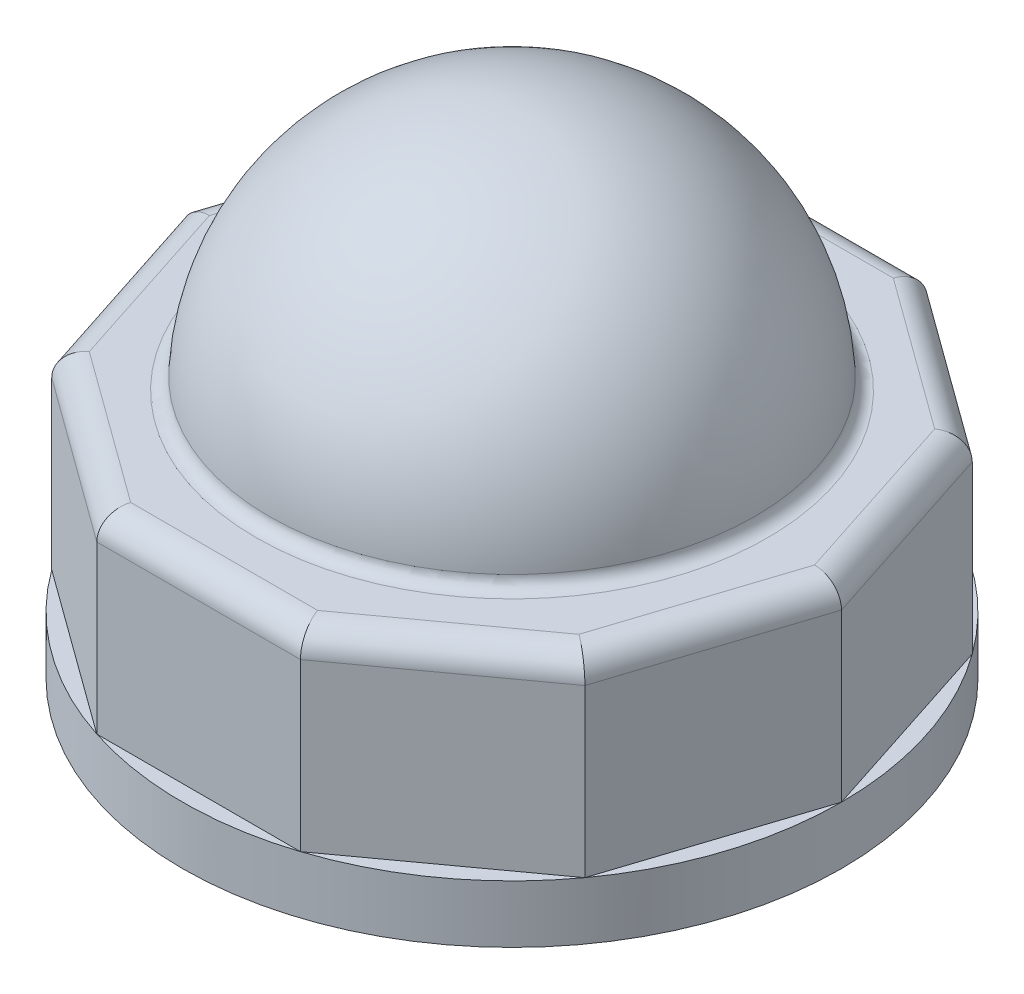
from build123d import *

# Parameters (mm, degrees)
ENL_V_START             = 5
ESQUISSE2_OUTSIDE_W     = 70.024
ESQUISSE2_OUTSIDE_H     = 70.024
ENL_V_MAT_EXTRU_2_DEPTH = 20
CONG_1_R                = 1
CONG_2_R                = 2


with BuildPart() as part:
    # Esquisse1 → R_volution1 (revolve)
    with BuildSketch(Plane.XY, mode=Mode.PRIVATE) as r_volution1_sk:
        with BuildLine():
            Line((18, 16), (18, 17))
            Line((18, 17), (16, 17))
            Line((16, 17), (16, 20))
            ThreePointArc((16, 20), (11.313708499, 31.313708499), (0, 36))
            Line((0, 36), (0, 39))
            ThreePointArc((0, 39), (13.435028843, 33.435028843), (19, 20))
            Line((19, 20), (25.75, 20))
            Line((25.75, 20), (25.75, 0.5))
            Line((25.75, 0.5), (24, 0.5))
            Line((24, 0.5), (24, 0))
            Line((24, 0), (23.5, 0))
            Line((23.5, 0), (23.5, 1))
            Line((23.5, 1), (23, 1))
            Line((23, 1), (23, 3))
            Line((23, 3), (21, 3))
            Line((21, 3), (21, 16))
            Line((21, 16), (18, 16))
        make_face()
    revolve(r_volution1_sk.sketch.rotate(Axis((0, 0, 0), (0, 1, 0)), 90), axis=Axis((0, 0, 0), (0, 1, 0)))

    # Esquisse2 outside → Enl_v. mat.-Extru.2 (cut)
    with BuildSketch(Plane(origin=(0, 0, 0), x_dir=(1, 0, 0), z_dir=(0, 1, 0)).offset(ENL_V_START)):
        Rectangle(ESQUISSE2_OUTSIDE_W, ESQUISSE2_OUTSIDE_H)
        Polygon((-7.957187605, 24.489705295), (7.957187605, 24.489705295), (20.832187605, 15.135470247), (25.75, 0), (20.832187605, -15.135470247), (7.957187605, -24.489705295), (-7.957187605, -24.489705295), (-20.832187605, -15.135470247), (-25.75, 0), (-20.832187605, 15.135470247), align=None, mode=Mode.SUBTRACT)
    extrude(amount=ENL_V_MAT_EXTRU_2_DEPTH, mode=Mode.SUBTRACT)

    # Cong_1
    cong_1_edges = [part.edges().sort_by_distance(p)[0] for p in [
        (0, 20, 19),
    ]]
    fillet(cong_1_edges, radius=CONG_1_R)

    # Cong_2
    cong_2_edges = [part.edges().sort_by_distance(p)[0] for p in [
        (-14.394687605, 20, -19.812587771),
        (-23.291093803, 20, -7.567735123),
        (-23.291093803, 20, 7.567735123),
        (-14.394687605, 20, 19.812587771),
        (0, 20, 24.489705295),
        (14.394687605, 20, 19.812587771),
        (23.291093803, 20, 7.567735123),
        (23.291093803, 20, -7.567735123),
        (14.394687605, 20, -19.812587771),
        (0, 20, -24.489705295),
    ]]
    fillet(cong_2_edges, radius=CONG_2_R)


solid = part.part
